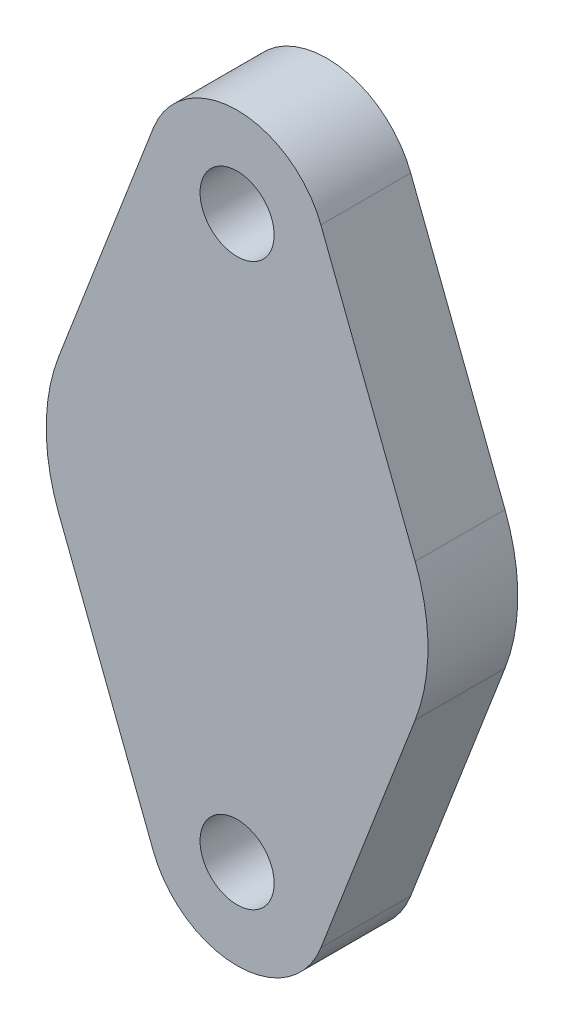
ISO-10303-21;
HEADER;
FILE_DESCRIPTION(('STEP AP214'),'2;1');
FILE_NAME('part.step','',(''),(''),'','','');
FILE_SCHEMA(('AUTOMOTIVE_DESIGN { 1 0 10303 214 1 1 1 1 }'));
ENDSEC;
DATA;
#1=APPLICATION_CONTEXT('core data for automotive mechanical design processes');
#2=APPLICATION_PROTOCOL_DEFINITION('international standard','automotive_design',2000,#1);
#3=PRODUCT_CONTEXT('',#1,'mechanical');
#4=PRODUCT('Part','Part','',(#3));
#5=PRODUCT_RELATED_PRODUCT_CATEGORY('part','',(#4));
#6=PRODUCT_DEFINITION_FORMATION('','',#4);
#7=PRODUCT_DEFINITION_CONTEXT('part definition',#1,'design');
#8=PRODUCT_DEFINITION('design','',#6,#7);
#9=PRODUCT_DEFINITION_SHAPE('','',#8);
#10=(LENGTH_UNIT() NAMED_UNIT(*) SI_UNIT(.MILLI.,.METRE.));
#11=(NAMED_UNIT(*) PLANE_ANGLE_UNIT() SI_UNIT($,.RADIAN.));
#12=(NAMED_UNIT(*) SI_UNIT($,.STERADIAN.) SOLID_ANGLE_UNIT());
#13=UNCERTAINTY_MEASURE_WITH_UNIT(LENGTH_MEASURE(1.E-05),#10,'distance_accuracy_value','');
#14=(GEOMETRIC_REPRESENTATION_CONTEXT(3) GLOBAL_UNCERTAINTY_ASSIGNED_CONTEXT((#13)) GLOBAL_UNIT_ASSIGNED_CONTEXT((#10,
#11,#12)) REPRESENTATION_CONTEXT('',''));
#15=CARTESIAN_POINT('',(0.,0.,0.));
#16=DIRECTION('',(0.,0.,1.));
#17=DIRECTION('',(1.,0.,0.));
#18=AXIS2_PLACEMENT_3D('',#15,#16,#17);
#19=CARTESIAN_POINT('',(0.,-12.5001927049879,-4.));
#20=DIRECTION('',(0.,0.,1.));
#21=DIRECTION('',(1.,0.,0.));
#22=AXIS2_PLACEMENT_3D('',#19,#20,#21);
#23=CYLINDRICAL_SURFACE('',#22,3.99980729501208);
#24=CARTESIAN_POINT('',(0.,-12.5001927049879,0.));
#25=DIRECTION('',(0.,0.,1.));
#26=DIRECTION('',(-1.,0.,0.));
#27=AXIS2_PLACEMENT_3D('',#24,#25,#26);
#28=CIRCLE('',#27,3.99980729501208);
#29=CARTESIAN_POINT('',(-3.73161420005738,-13.9401627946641,0.));
#30=VERTEX_POINT('',#29);
#31=CARTESIAN_POINT('',(3.73161420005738,-13.9401627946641,0.));
#32=VERTEX_POINT('',#31);
#33=EDGE_CURVE('E134',#30,#32,#28,.T.);
#34=ORIENTED_EDGE('',*,*,#33,.F.);
#35=DIRECTION('',(0.,0.,1.));
#36=VECTOR('',#35,1.);
#37=CARTESIAN_POINT('',(-3.73161420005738,-13.9401627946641,-4.));
#38=LINE('',#37,#36);
#39=CARTESIAN_POINT('',(-3.73161420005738,-13.9401627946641,-4.));
#40=VERTEX_POINT('',#39);
#41=EDGE_CURVE('E44',#40,#30,#38,.T.);
#42=ORIENTED_EDGE('',*,*,#41,.F.);
#43=CARTESIAN_POINT('',(0.,-12.5001927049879,-4.));
#44=DIRECTION('',(0.,0.,1.));
#45=DIRECTION('',(-1.,0.,0.));
#46=AXIS2_PLACEMENT_3D('',#43,#44,#45);
#47=CIRCLE('',#46,3.99980729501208);
#48=CARTESIAN_POINT('',(3.73161420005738,-13.9401627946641,-4.));
#49=VERTEX_POINT('',#48);
#50=EDGE_CURVE('E156',#40,#49,#47,.T.);
#51=ORIENTED_EDGE('',*,*,#50,.T.);
#52=DIRECTION('',(0.,0.,1.));
#53=VECTOR('',#52,1.);
#54=CARTESIAN_POINT('',(3.73161420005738,-13.9401627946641,-4.));
#55=LINE('',#54,#53);
#56=EDGE_CURVE('E92',#49,#32,#55,.T.);
#57=ORIENTED_EDGE('',*,*,#56,.T.);
#58=EDGE_LOOP('',(#34,#42,#51,#57));
#59=FACE_BOUND('',#58,.T.);
#60=ADVANCED_FACE('F35',(#59),#23,.T.);
#61=CARTESIAN_POINT('',(-7.9300622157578,-3.06008386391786,-4.));
#62=DIRECTION('',(-0.932948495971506,-0.360009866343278,0.));
#63=DIRECTION('',(0.360009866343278,-0.932948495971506,0.));
#64=AXIS2_PLACEMENT_3D('',#61,#62,#63);
#65=PLANE('',#64);
#66=DIRECTION('',(0.360009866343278,-0.932948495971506,0.));
#67=VECTOR('',#66,1.);
#68=CARTESIAN_POINT('',(-7.9300622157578,-3.06008386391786,0.));
#69=LINE('',#68,#67);
#70=CARTESIAN_POINT('',(-7.9300622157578,-3.06008386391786,0.));
#71=VERTEX_POINT('',#70);
#72=EDGE_CURVE('E153',#71,#30,#69,.T.);
#73=ORIENTED_EDGE('',*,*,#72,.F.);
#74=DIRECTION('',(0.,0.,1.));
#75=VECTOR('',#74,1.);
#76=CARTESIAN_POINT('',(-7.9300622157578,-3.06008386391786,-4.));
#77=LINE('',#76,#75);
#78=CARTESIAN_POINT('',(-7.9300622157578,-3.06008386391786,-4.));
#79=VERTEX_POINT('',#78);
#80=EDGE_CURVE('E80',#79,#71,#77,.T.);
#81=ORIENTED_EDGE('',*,*,#80,.F.);
#82=DIRECTION('',(0.360009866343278,-0.932948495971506,0.));
#83=VECTOR('',#82,1.);
#84=CARTESIAN_POINT('',(-7.9300622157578,-3.06008386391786,-4.));
#85=LINE('',#84,#83);
#86=EDGE_CURVE('E124',#79,#40,#85,.T.);
#87=ORIENTED_EDGE('',*,*,#86,.T.);
#88=ORIENTED_EDGE('',*,*,#41,.T.);
#89=EDGE_LOOP('',(#73,#81,#87,#88));
#90=FACE_BOUND('',#89,.T.);
#91=ADVANCED_FACE('F169',(#90),#65,.T.);
#92=CARTESIAN_POINT('',(0.,0.,-4.));
#93=DIRECTION('',(0.,0.,1.));
#94=DIRECTION('',(1.,0.,0.));
#95=AXIS2_PLACEMENT_3D('',#92,#93,#94);
#96=CYLINDRICAL_SURFACE('',#95,8.5);
#97=CARTESIAN_POINT('',(0.,0.,0.));
#98=DIRECTION('',(0.,0.,1.));
#99=DIRECTION('',(-1.,0.,0.));
#100=AXIS2_PLACEMENT_3D('',#97,#98,#99);
#101=CIRCLE('',#100,8.5);
#102=CARTESIAN_POINT('',(-7.9300622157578,3.06008386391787,0.));
#103=VERTEX_POINT('',#102);
#104=EDGE_CURVE('E111',#103,#71,#101,.T.);
#105=ORIENTED_EDGE('',*,*,#104,.F.);
#106=DIRECTION('',(0.,0.,1.));
#107=VECTOR('',#106,1.);
#108=CARTESIAN_POINT('',(-7.9300622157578,3.06008386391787,-4.));
#109=LINE('',#108,#107);
#110=CARTESIAN_POINT('',(-7.9300622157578,3.06008386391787,-4.));
#111=VERTEX_POINT('',#110);
#112=EDGE_CURVE('E106',#111,#103,#109,.T.);
#113=ORIENTED_EDGE('',*,*,#112,.F.);
#114=CARTESIAN_POINT('',(0.,0.,-4.));
#115=DIRECTION('',(0.,0.,1.));
#116=DIRECTION('',(-1.,0.,0.));
#117=AXIS2_PLACEMENT_3D('',#114,#115,#116);
#118=CIRCLE('',#117,8.5);
#119=EDGE_CURVE('E109',#111,#79,#118,.T.);
#120=ORIENTED_EDGE('',*,*,#119,.T.);
#121=ORIENTED_EDGE('',*,*,#80,.T.);
#122=EDGE_LOOP('',(#105,#113,#120,#121));
#123=FACE_BOUND('',#122,.T.);
#124=ADVANCED_FACE('F108',(#123),#96,.T.);
#125=CARTESIAN_POINT('',(-7.9300622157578,3.06008386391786,-4.));
#126=DIRECTION('',(-0.932948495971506,0.360009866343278,0.));
#127=DIRECTION('',(-0.360009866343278,-0.932948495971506,0.));
#128=AXIS2_PLACEMENT_3D('',#125,#126,#127);
#129=PLANE('',#128);
#130=DIRECTION('',(-0.360009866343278,-0.932948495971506,0.));
#131=VECTOR('',#130,1.);
#132=CARTESIAN_POINT('',(-7.9300622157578,3.06008386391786,0.));
#133=LINE('',#132,#131);
#134=CARTESIAN_POINT('',(-3.73161420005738,13.9401627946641,0.));
#135=VERTEX_POINT('',#134);
#136=EDGE_CURVE('E150',#135,#103,#133,.T.);
#137=ORIENTED_EDGE('',*,*,#136,.F.);
#138=DIRECTION('',(0.,0.,1.));
#139=VECTOR('',#138,1.);
#140=CARTESIAN_POINT('',(-3.73161420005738,13.9401627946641,-4.));
#141=LINE('',#140,#139);
#142=CARTESIAN_POINT('',(-3.73161420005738,13.9401627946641,-4.));
#143=VERTEX_POINT('',#142);
#144=EDGE_CURVE('E116',#143,#135,#141,.T.);
#145=ORIENTED_EDGE('',*,*,#144,.F.);
#146=DIRECTION('',(-0.360009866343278,-0.932948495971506,0.));
#147=VECTOR('',#146,1.);
#148=CARTESIAN_POINT('',(-7.9300622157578,3.06008386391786,-4.));
#149=LINE('',#148,#147);
#150=EDGE_CURVE('E122',#143,#111,#149,.T.);
#151=ORIENTED_EDGE('',*,*,#150,.T.);
#152=ORIENTED_EDGE('',*,*,#112,.T.);
#153=EDGE_LOOP('',(#137,#145,#151,#152));
#154=FACE_BOUND('',#153,.T.);
#155=ADVANCED_FACE('F126',(#154),#129,.T.);
#156=CARTESIAN_POINT('',(0.,12.5001927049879,-4.));
#157=DIRECTION('',(0.,0.,1.));
#158=DIRECTION('',(1.,0.,0.));
#159=AXIS2_PLACEMENT_3D('',#156,#157,#158);
#160=CYLINDRICAL_SURFACE('',#159,3.99980729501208);
#161=CARTESIAN_POINT('',(0.,12.5001927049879,0.));
#162=DIRECTION('',(0.,0.,1.));
#163=DIRECTION('',(1.,0.,0.));
#164=AXIS2_PLACEMENT_3D('',#161,#162,#163);
#165=CIRCLE('',#164,3.99980729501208);
#166=CARTESIAN_POINT('',(3.73161420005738,13.9401627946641,0.));
#167=VERTEX_POINT('',#166);
#168=EDGE_CURVE('E147',#167,#135,#165,.T.);
#169=ORIENTED_EDGE('',*,*,#168,.F.);
#170=DIRECTION('',(0.,0.,1.));
#171=VECTOR('',#170,1.);
#172=CARTESIAN_POINT('',(3.73161420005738,13.9401627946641,-4.));
#173=LINE('',#172,#171);
#174=CARTESIAN_POINT('',(3.73161420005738,13.9401627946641,-4.));
#175=VERTEX_POINT('',#174);
#176=EDGE_CURVE('E160',#175,#167,#173,.T.);
#177=ORIENTED_EDGE('',*,*,#176,.F.);
#178=CARTESIAN_POINT('',(0.,12.5001927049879,-4.));
#179=DIRECTION('',(0.,0.,1.));
#180=DIRECTION('',(1.,0.,0.));
#181=AXIS2_PLACEMENT_3D('',#178,#179,#180);
#182=CIRCLE('',#181,3.99980729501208);
#183=EDGE_CURVE('E127',#175,#143,#182,.T.);
#184=ORIENTED_EDGE('',*,*,#183,.T.);
#185=ORIENTED_EDGE('',*,*,#144,.T.);
#186=EDGE_LOOP('',(#169,#177,#184,#185));
#187=FACE_BOUND('',#186,.T.);
#188=ADVANCED_FACE('F182',(#187),#160,.T.);
#189=CARTESIAN_POINT('',(7.9300622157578,3.06008386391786,-4.));
#190=DIRECTION('',(0.932948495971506,0.360009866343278,0.));
#191=DIRECTION('',(-0.360009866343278,0.932948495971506,0.));
#192=AXIS2_PLACEMENT_3D('',#189,#190,#191);
#193=PLANE('',#192);
#194=DIRECTION('',(-0.360009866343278,0.932948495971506,0.));
#195=VECTOR('',#194,1.);
#196=CARTESIAN_POINT('',(7.9300622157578,3.06008386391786,0.));
#197=LINE('',#196,#195);
#198=CARTESIAN_POINT('',(7.9300622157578,3.06008386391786,0.));
#199=VERTEX_POINT('',#198);
#200=EDGE_CURVE('E144',#199,#167,#197,.T.);
#201=ORIENTED_EDGE('',*,*,#200,.F.);
#202=DIRECTION('',(0.,0.,1.));
#203=VECTOR('',#202,1.);
#204=CARTESIAN_POINT('',(7.9300622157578,3.06008386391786,-4.));
#205=LINE('',#204,#203);
#206=CARTESIAN_POINT('',(7.9300622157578,3.06008386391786,-4.));
#207=VERTEX_POINT('',#206);
#208=EDGE_CURVE('E162',#207,#199,#205,.T.);
#209=ORIENTED_EDGE('',*,*,#208,.F.);
#210=DIRECTION('',(-0.360009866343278,0.932948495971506,0.));
#211=VECTOR('',#210,1.);
#212=CARTESIAN_POINT('',(7.9300622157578,3.06008386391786,-4.));
#213=LINE('',#212,#211);
#214=EDGE_CURVE('E129',#207,#175,#213,.T.);
#215=ORIENTED_EDGE('',*,*,#214,.T.);
#216=ORIENTED_EDGE('',*,*,#176,.T.);
#217=EDGE_LOOP('',(#201,#209,#215,#216));
#218=FACE_BOUND('',#217,.T.);
#219=ADVANCED_FACE('F185',(#218),#193,.T.);
#220=CARTESIAN_POINT('',(0.,0.,-4.));
#221=DIRECTION('',(0.,0.,1.));
#222=DIRECTION('',(1.,0.,0.));
#223=AXIS2_PLACEMENT_3D('',#220,#221,#222);
#224=CYLINDRICAL_SURFACE('',#223,8.5);
#225=CARTESIAN_POINT('',(0.,0.,0.));
#226=DIRECTION('',(0.,0.,1.));
#227=DIRECTION('',(1.,0.,0.));
#228=AXIS2_PLACEMENT_3D('',#225,#226,#227);
#229=CIRCLE('',#228,8.5);
#230=CARTESIAN_POINT('',(7.9300622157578,-3.06008386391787,0.));
#231=VERTEX_POINT('',#230);
#232=EDGE_CURVE('E141',#231,#199,#229,.T.);
#233=ORIENTED_EDGE('',*,*,#232,.F.);
#234=DIRECTION('',(0.,0.,1.));
#235=VECTOR('',#234,1.);
#236=CARTESIAN_POINT('',(7.9300622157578,-3.06008386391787,-4.));
#237=LINE('',#236,#235);
#238=CARTESIAN_POINT('',(7.9300622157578,-3.06008386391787,-4.));
#239=VERTEX_POINT('',#238);
#240=EDGE_CURVE('E164',#239,#231,#237,.T.);
#241=ORIENTED_EDGE('',*,*,#240,.F.);
#242=CARTESIAN_POINT('',(0.,0.,-4.));
#243=DIRECTION('',(0.,0.,1.));
#244=DIRECTION('',(1.,0.,0.));
#245=AXIS2_PLACEMENT_3D('',#242,#243,#244);
#246=CIRCLE('',#245,8.5);
#247=EDGE_CURVE('E241',#239,#207,#246,.T.);
#248=ORIENTED_EDGE('',*,*,#247,.T.);
#249=ORIENTED_EDGE('',*,*,#208,.T.);
#250=EDGE_LOOP('',(#233,#241,#248,#249));
#251=FACE_BOUND('',#250,.T.);
#252=ADVANCED_FACE('F189',(#251),#224,.T.);
#253=CARTESIAN_POINT('',(7.9300622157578,-3.06008386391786,-4.));
#254=DIRECTION('',(0.932948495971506,-0.360009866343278,0.));
#255=DIRECTION('',(0.360009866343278,0.932948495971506,0.));
#256=AXIS2_PLACEMENT_3D('',#253,#254,#255);
#257=PLANE('',#256);
#258=DIRECTION('',(0.360009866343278,0.932948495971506,0.));
#259=VECTOR('',#258,1.);
#260=CARTESIAN_POINT('',(7.9300622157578,-3.06008386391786,0.));
#261=LINE('',#260,#259);
#262=EDGE_CURVE('E137',#32,#231,#261,.T.);
#263=ORIENTED_EDGE('',*,*,#262,.F.);
#264=ORIENTED_EDGE('',*,*,#56,.F.);
#265=DIRECTION('',(0.360009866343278,0.932948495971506,0.));
#266=VECTOR('',#265,1.);
#267=CARTESIAN_POINT('',(7.9300622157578,-3.06008386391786,-4.));
#268=LINE('',#267,#266);
#269=EDGE_CURVE('E239',#49,#239,#268,.T.);
#270=ORIENTED_EDGE('',*,*,#269,.T.);
#271=ORIENTED_EDGE('',*,*,#240,.T.);
#272=EDGE_LOOP('',(#263,#264,#270,#271));
#273=FACE_BOUND('',#272,.T.);
#274=ADVANCED_FACE('F165',(#273),#257,.T.);
#275=CARTESIAN_POINT('',(0.,-12.5001927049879,-4.));
#276=DIRECTION('',(0.,0.,-1.));
#277=DIRECTION('',(-1.,0.,0.));
#278=AXIS2_PLACEMENT_3D('',#275,#276,#277);
#279=PLANE('',#278);
#280=CARTESIAN_POINT('',(0.,0.,-4.));
#281=DIRECTION('',(0.,0.,-1.));
#282=DIRECTION('',(-1.,0.,0.));
#283=AXIS2_PLACEMENT_3D('',#280,#281,#282);
#284=CIRCLE('',#283,8.);
#285=CARTESIAN_POINT('',(-8.,0.,-4.));
#286=VERTEX_POINT('',#285);
#287=EDGE_CURVE('E11',#286,#286,#284,.F.);
#288=ORIENTED_EDGE('',*,*,#287,.T.);
#289=EDGE_LOOP('',(#288));
#290=FACE_BOUND('',#289,.T.);
#291=CARTESIAN_POINT('',(0.,12.5001927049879,-4.));
#292=DIRECTION('',(0.,0.,1.));
#293=DIRECTION('',(-1.,0.,0.));
#294=AXIS2_PLACEMENT_3D('',#291,#292,#293);
#295=CIRCLE('',#294,1.65);
#296=CARTESIAN_POINT('',(-1.65,12.5001927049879,-4.));
#297=VERTEX_POINT('',#296);
#298=EDGE_CURVE('E228',#297,#297,#295,.T.);
#299=ORIENTED_EDGE('',*,*,#298,.T.);
#300=EDGE_LOOP('',(#299));
#301=FACE_BOUND('',#300,.T.);
#302=CARTESIAN_POINT('',(0.,-12.5001927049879,-4.));
#303=DIRECTION('',(0.,0.,1.));
#304=DIRECTION('',(1.,0.,0.));
#305=AXIS2_PLACEMENT_3D('',#302,#303,#304);
#306=CIRCLE('',#305,1.65);
#307=CARTESIAN_POINT('',(1.65,-12.5001927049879,-4.));
#308=VERTEX_POINT('',#307);
#309=EDGE_CURVE('E138',#308,#308,#306,.T.);
#310=ORIENTED_EDGE('',*,*,#309,.T.);
#311=EDGE_LOOP('',(#310));
#312=FACE_BOUND('',#311,.T.);
#313=ORIENTED_EDGE('',*,*,#50,.F.);
#314=ORIENTED_EDGE('',*,*,#86,.F.);
#315=ORIENTED_EDGE('',*,*,#119,.F.);
#316=ORIENTED_EDGE('',*,*,#150,.F.);
#317=ORIENTED_EDGE('',*,*,#183,.F.);
#318=ORIENTED_EDGE('',*,*,#214,.F.);
#319=ORIENTED_EDGE('',*,*,#247,.F.);
#320=ORIENTED_EDGE('',*,*,#269,.F.);
#321=EDGE_LOOP('',(#313,#314,#315,#316,#317,#318,#319,#320));
#322=FACE_BOUND('',#321,.T.);
#323=ADVANCED_FACE('F120',(#290,#301,#312,#322),#279,.T.);
#324=CARTESIAN_POINT('',(0.,-12.5001927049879,0.));
#325=DIRECTION('',(0.,0.,-1.));
#326=DIRECTION('',(-1.,0.,0.));
#327=AXIS2_PLACEMENT_3D('',#324,#325,#326);
#328=PLANE('',#327);
#329=CARTESIAN_POINT('',(0.,12.5001927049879,0.));
#330=DIRECTION('',(0.,0.,1.));
#331=DIRECTION('',(-1.,0.,0.));
#332=AXIS2_PLACEMENT_3D('',#329,#330,#331);
#333=CIRCLE('',#332,1.65);
#334=CARTESIAN_POINT('',(-1.65,12.5001927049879,0.));
#335=VERTEX_POINT('',#334);
#336=EDGE_CURVE('E225',#335,#335,#333,.T.);
#337=ORIENTED_EDGE('',*,*,#336,.F.);
#338=EDGE_LOOP('',(#337));
#339=FACE_BOUND('',#338,.T.);
#340=CARTESIAN_POINT('',(0.,-12.5001927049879,0.));
#341=DIRECTION('',(0.,0.,1.));
#342=DIRECTION('',(1.,0.,0.));
#343=AXIS2_PLACEMENT_3D('',#340,#341,#342);
#344=CIRCLE('',#343,1.65);
#345=CARTESIAN_POINT('',(1.65,-12.5001927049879,0.));
#346=VERTEX_POINT('',#345);
#347=EDGE_CURVE('E232',#346,#346,#344,.T.);
#348=ORIENTED_EDGE('',*,*,#347,.F.);
#349=EDGE_LOOP('',(#348));
#350=FACE_BOUND('',#349,.T.);
#351=ORIENTED_EDGE('',*,*,#33,.T.);
#352=ORIENTED_EDGE('',*,*,#262,.T.);
#353=ORIENTED_EDGE('',*,*,#232,.T.);
#354=ORIENTED_EDGE('',*,*,#200,.T.);
#355=ORIENTED_EDGE('',*,*,#168,.T.);
#356=ORIENTED_EDGE('',*,*,#136,.T.);
#357=ORIENTED_EDGE('',*,*,#104,.T.);
#358=ORIENTED_EDGE('',*,*,#72,.T.);
#359=EDGE_LOOP('',(#351,#352,#353,#354,#355,#356,#357,#358));
#360=FACE_BOUND('',#359,.T.);
#361=ADVANCED_FACE('F168',(#339,#350,#360),#328,.F.);
#362=CARTESIAN_POINT('',(0.,-12.5001927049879,-4.));
#363=DIRECTION('',(0.,0.,1.));
#364=DIRECTION('',(1.,0.,0.));
#365=AXIS2_PLACEMENT_3D('',#362,#363,#364);
#366=CYLINDRICAL_SURFACE('',#365,1.65);
#367=ORIENTED_EDGE('',*,*,#309,.F.);
#368=EDGE_LOOP('',(#367));
#369=FACE_BOUND('',#368,.T.);
#370=ORIENTED_EDGE('',*,*,#347,.T.);
#371=EDGE_LOOP('',(#370));
#372=FACE_BOUND('',#371,.T.);
#373=ADVANCED_FACE('F204',(#369,#372),#366,.F.);
#374=CARTESIAN_POINT('',(0.,12.5001927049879,-4.));
#375=DIRECTION('',(0.,0.,1.));
#376=DIRECTION('',(1.,0.,0.));
#377=AXIS2_PLACEMENT_3D('',#374,#375,#376);
#378=CYLINDRICAL_SURFACE('',#377,1.65);
#379=ORIENTED_EDGE('',*,*,#298,.F.);
#380=EDGE_LOOP('',(#379));
#381=FACE_BOUND('',#380,.T.);
#382=ORIENTED_EDGE('',*,*,#336,.T.);
#383=EDGE_LOOP('',(#382));
#384=FACE_BOUND('',#383,.T.);
#385=ADVANCED_FACE('F210',(#381,#384),#378,.F.);
#386=CARTESIAN_POINT('',(0.,0.,-2.));
#387=DIRECTION('',(0.,0.,-1.));
#388=DIRECTION('',(-1.,0.,0.));
#389=AXIS2_PLACEMENT_3D('',#386,#387,#388);
#390=PLANE('',#389);
#391=CARTESIAN_POINT('',(0.,0.,-2.));
#392=DIRECTION('',(0.,0.,-1.));
#393=DIRECTION('',(-1.,0.,0.));
#394=AXIS2_PLACEMENT_3D('',#391,#392,#393);
#395=CIRCLE('',#394,6.);
#396=CARTESIAN_POINT('',(-6.,0.,-2.));
#397=VERTEX_POINT('',#396);
#398=EDGE_CURVE('E223',#397,#397,#395,.T.);
#399=ORIENTED_EDGE('',*,*,#398,.T.);
#400=EDGE_LOOP('',(#399));
#401=FACE_BOUND('',#400,.T.);
#402=ADVANCED_FACE('F214',(#401),#390,.T.);
#403=CARTESIAN_POINT('',(0.,0.,-2.));
#404=DIRECTION('',(0.,0.,-1.));
#405=DIRECTION('',(-1.,0.,0.));
#406=AXIS2_PLACEMENT_3D('',#403,#404,#405);
#407=CONICAL_SURFACE('',#406,6.,0.78539816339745);
#408=ORIENTED_EDGE('',*,*,#287,.F.);
#409=EDGE_LOOP('',(#408));
#410=FACE_BOUND('',#409,.T.);
#411=ORIENTED_EDGE('',*,*,#398,.F.);
#412=EDGE_LOOP('',(#411));
#413=FACE_BOUND('',#412,.T.);
#414=ADVANCED_FACE('F37',(#410,#413),#407,.F.);
#415=CLOSED_SHELL('',(#60,#91,#124,#155,#188,#219,#252,#274,#323,#361,#373,#385,#402,#414));
#416=MANIFOLD_SOLID_BREP('B2',#415);
#417=ADVANCED_BREP_SHAPE_REPRESENTATION('',(#18,#416),#14);
#418=SHAPE_DEFINITION_REPRESENTATION(#9,#417);
ENDSEC;
END-ISO-10303-21;
